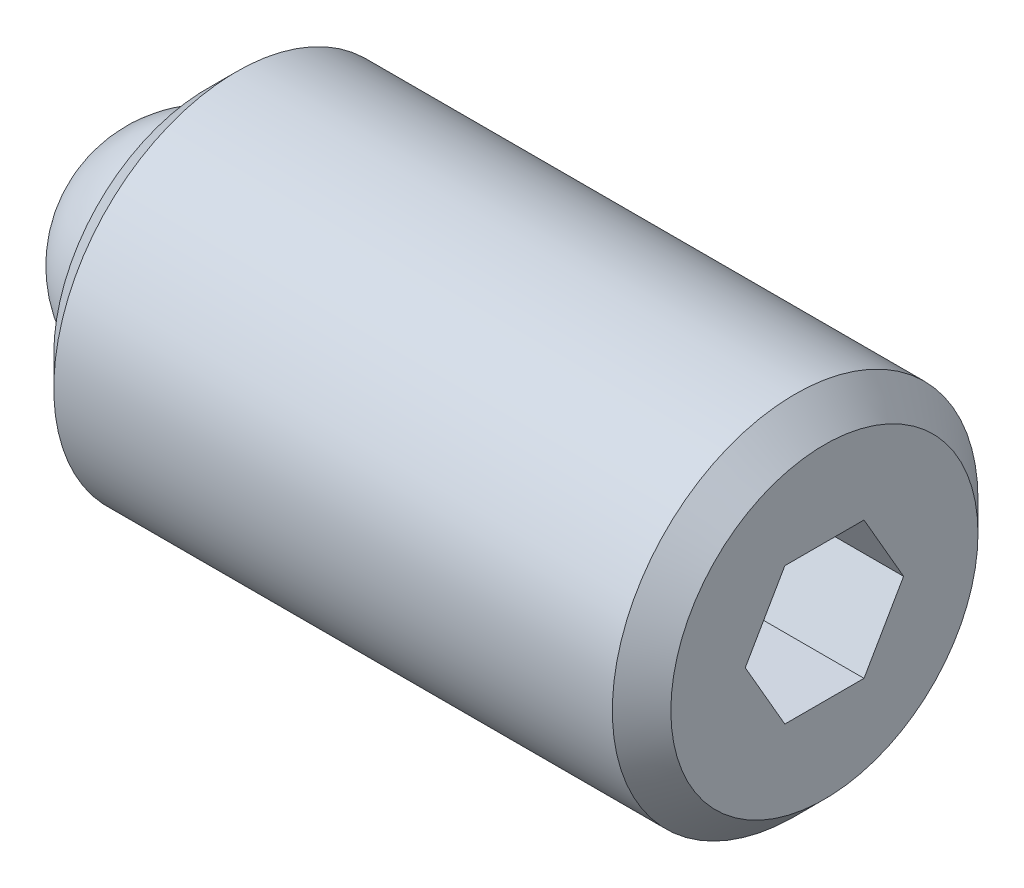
from build123d import *

# Parameters (mm, degrees)
SKETCH2_R           = 3.175
BOSS_EXTRUDE1_DEPTH = 10.715625
CHAMFER1_SIZE       = 0.508
CHAMFER2_SIZE       = 0.508
CUT_EXTRUDE2_DEPTH  = 2.286
SKETCH3_R           = 1.9812
CUT_EXTRUDE3_DEPTH  = 1.984375


with BuildPart() as part:
    # Sketch2 → Boss-Extrude1 (new body)
    with BuildSketch(Plane(origin=(0, 0, 0), x_dir=(0, 0, -1), z_dir=(1, 0, 0))):
        Circle(SKETCH2_R)
    extrude(amount=BOSS_EXTRUDE1_DEPTH)

    # Chamfer1
    chamfer1_edges = [part.edges().sort_by_distance(p)[0] for p in [
        (0, 0, 3.175),
    ]]
    chamfer(chamfer1_edges, length=CHAMFER1_SIZE)

    # Chamfer2
    chamfer2_edges = [part.edges().sort_by_distance(p)[0] for p in [
        (10.715625, 0, 3.175),
    ]]
    chamfer(chamfer2_edges, length=CHAMFER2_SIZE)

    # Sketch4 → Cut-Extrude2 (cut)
    with BuildSketch(Plane(origin=(10.715625, 0, 0), x_dir=(0, 0, -1), z_dir=(1, 0, 0))):
        Polygon((1.374815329, 0), (0.687407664, 1.190625), (-0.687407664, 1.190625), (-1.374815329, 0), (-0.687407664, -1.190625), (0.687407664, -1.190625), align=None)
    extrude(amount=-CUT_EXTRUDE2_DEPTH, mode=Mode.SUBTRACT)

    # Sketch3 → Cut-Extrude3 (cut)
    with BuildSketch(Plane.ZY):
        Circle(SKETCH3_R)
    extrude(amount=-CUT_EXTRUDE3_DEPTH, mode=Mode.SUBTRACT)


with BuildPart() as body_2:
    # Sketch5 → Revolve1 (revolve)
    with BuildSketch(Plane.ZY):
        with BuildLine():
            Line((0, 0), (0, -1.984375))
            ThreePointArc((0, -1.984375), (-1.984375, 0), (0, 1.984375))
            Line((0, 1.984375), (0, 0))
        make_face()
    revolve(axis=Axis((0, 0, 0), (0, 1, 0)))


solid = Compound([part.part, body_2.part])
